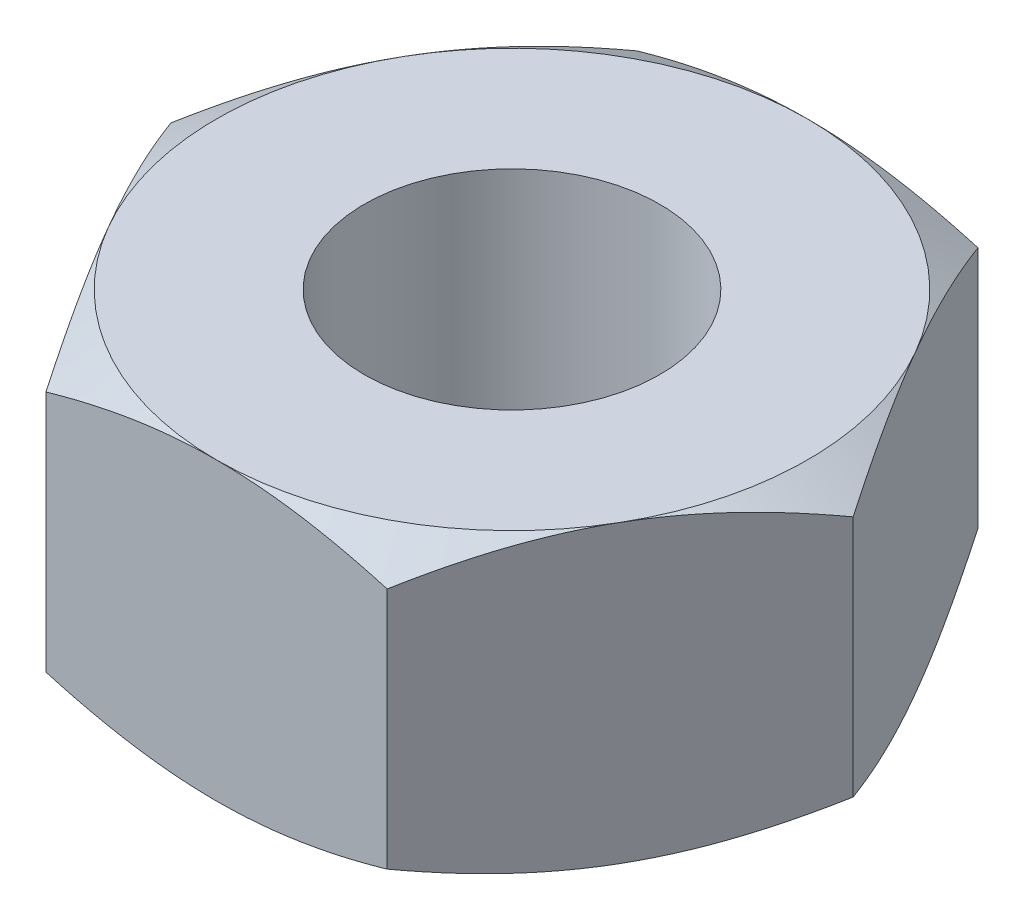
ISO-10303-21;
HEADER;
FILE_DESCRIPTION(('STEP AP214'),'2;1');
FILE_NAME('part.step','',(''),(''),'','','');
FILE_SCHEMA(('AUTOMOTIVE_DESIGN { 1 0 10303 214 1 1 1 1 }'));
ENDSEC;
DATA;
#1=APPLICATION_CONTEXT('core data for automotive mechanical design processes');
#2=APPLICATION_PROTOCOL_DEFINITION('international standard','automotive_design',2000,#1);
#3=PRODUCT_CONTEXT('',#1,'mechanical');
#4=PRODUCT('Part','Part','',(#3));
#5=PRODUCT_RELATED_PRODUCT_CATEGORY('part','',(#4));
#6=PRODUCT_DEFINITION_FORMATION('','',#4);
#7=PRODUCT_DEFINITION_CONTEXT('part definition',#1,'design');
#8=PRODUCT_DEFINITION('design','',#6,#7);
#9=PRODUCT_DEFINITION_SHAPE('','',#8);
#10=(LENGTH_UNIT() NAMED_UNIT(*) SI_UNIT(.MILLI.,.METRE.));
#11=(NAMED_UNIT(*) PLANE_ANGLE_UNIT() SI_UNIT($,.RADIAN.));
#12=(NAMED_UNIT(*) SI_UNIT($,.STERADIAN.) SOLID_ANGLE_UNIT());
#13=UNCERTAINTY_MEASURE_WITH_UNIT(LENGTH_MEASURE(1.E-05),#10,'distance_accuracy_value','');
#14=(GEOMETRIC_REPRESENTATION_CONTEXT(3) GLOBAL_UNCERTAINTY_ASSIGNED_CONTEXT((#13)) GLOBAL_UNIT_ASSIGNED_CONTEXT((#10,
#11,#12)) REPRESENTATION_CONTEXT('',''));
#15=CARTESIAN_POINT('',(0.,0.,0.));
#16=DIRECTION('',(0.,0.,1.));
#17=DIRECTION('',(1.,0.,0.));
#18=AXIS2_PLACEMENT_3D('',#15,#16,#17);
#19=CARTESIAN_POINT('',(2.88675134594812,2.5,5.00000000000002));
#20=DIRECTION('',(-0.866025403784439,0.,-0.499999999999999));
#21=DIRECTION('',(-0.499999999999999,0.,0.866025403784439));
#22=AXIS2_PLACEMENT_3D('',#19,#20,#21);
#23=PLANE('',#22);
#24=CARTESIAN_POINT('',(5.7736181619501,-2.05335134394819,-0.000200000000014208));
#25=CARTESIAN_POINT('',(5.64675433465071,-2.12661343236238,0.219534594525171));
#26=CARTESIAN_POINT('',(5.5188054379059,-2.19324867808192,0.441148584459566));
#27=CARTESIAN_POINT('',(5.26069210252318,-2.3095610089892,0.888213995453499));
#28=CARTESIAN_POINT('',(5.13052307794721,-2.35919695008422,1.11367335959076));
#29=CARTESIAN_POINT('',(4.87177839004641,-2.43644897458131,1.56183230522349));
#30=CARTESIAN_POINT('',(4.74324302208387,-2.46457962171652,1.78446209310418));
#31=CARTESIAN_POINT('',(4.54998783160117,-2.48980507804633,2.11918990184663));
#32=CARTESIAN_POINT('',(4.48552534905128,-2.49538654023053,2.23084219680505));
#33=CARTESIAN_POINT('',(4.35654081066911,-2.50079778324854,2.45424997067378));
#34=CARTESIAN_POINT('',(4.2920187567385,-2.50062774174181,2.5660054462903));
#35=CARTESIAN_POINT('',(4.11524635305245,-2.49224636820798,2.87218423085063));
#36=CARTESIAN_POINT('',(4.00305457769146,-2.47817022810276,3.0665060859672));
#37=CARTESIAN_POINT('',(3.77941563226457,-2.43353474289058,3.4538601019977));
#38=CARTESIAN_POINT('',(3.66796924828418,-2.40296013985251,3.64689090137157));
#39=CARTESIAN_POINT('',(3.44387972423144,-2.32653150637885,4.03502534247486));
#40=CARTESIAN_POINT('',(3.3312648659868,-2.28035362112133,4.23007999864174));
#41=CARTESIAN_POINT('',(3.1077146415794,-2.17554820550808,4.61728034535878));
#42=CARTESIAN_POINT('',(2.99677641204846,-2.11694529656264,4.8094309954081));
#43=CARTESIAN_POINT('',(2.88663587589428,-2.05335134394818,5.00020000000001));
#44=B_SPLINE_CURVE_WITH_KNOTS('',3,(#24,#25,#26,#27,#28,#29,#30,#31,#32,#33,#34,#35,#36,#37,#38,
#39,#40,#41,#42,#43),.UNSPECIFIED.,.F.,.F.,(4,2,2,2,2,2,2,2,2,4),(0.,0.792555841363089,
1.58701660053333,2.3618153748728,2.74884076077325,3.13585419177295,3.8096236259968,
4.4840172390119,5.17336882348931,5.86136694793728),.UNSPECIFIED.);
#45=CARTESIAN_POINT('',(5.77350269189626,-2.05341801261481,0.));
#46=VERTEX_POINT('',#45);
#47=CARTESIAN_POINT('',(4.33012701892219,-2.5,2.5));
#48=VERTEX_POINT('',#47);
#49=EDGE_CURVE('E47',#46,#48,#44,.T.);
#50=ORIENTED_EDGE('',*,*,#49,.F.);
#51=DIRECTION('',(0.,-1.,0.));
#52=VECTOR('',#51,1.);
#53=CARTESIAN_POINT('',(5.77350269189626,2.5,0.));
#54=LINE('',#53,#52);
#55=CARTESIAN_POINT('',(5.77350269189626,2.05341801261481,0.));
#56=VERTEX_POINT('',#55);
#57=EDGE_CURVE('E163',#56,#46,#54,.T.);
#58=ORIENTED_EDGE('',*,*,#57,.F.);
#59=CARTESIAN_POINT('',(2.88663587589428,2.05335134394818,5.00020000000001));
#60=CARTESIAN_POINT('',(3.01349970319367,2.12661343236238,4.78046540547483));
#61=CARTESIAN_POINT('',(3.14144859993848,2.19324867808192,4.55885141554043));
#62=CARTESIAN_POINT('',(3.3995619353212,2.3095610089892,4.1117860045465));
#63=CARTESIAN_POINT('',(3.52973095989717,2.35919695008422,3.88632664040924));
#64=CARTESIAN_POINT('',(3.78847564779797,2.43644897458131,3.4381676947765));
#65=CARTESIAN_POINT('',(3.91701101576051,2.46457962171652,3.21553790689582));
#66=CARTESIAN_POINT('',(4.11026620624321,2.48980507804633,2.88081009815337));
#67=CARTESIAN_POINT('',(4.1747286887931,2.49538654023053,2.76915780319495));
#68=CARTESIAN_POINT('',(4.30371322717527,2.50079778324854,2.54575002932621));
#69=CARTESIAN_POINT('',(4.36823528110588,2.50062774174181,2.4339945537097));
#70=CARTESIAN_POINT('',(4.54500768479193,2.49224636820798,2.12781576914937));
#71=CARTESIAN_POINT('',(4.65719946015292,2.47817022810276,1.93349391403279));
#72=CARTESIAN_POINT('',(4.88083840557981,2.43353474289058,1.5461398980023));
#73=CARTESIAN_POINT('',(4.9922847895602,2.40296013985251,1.35310909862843));
#74=CARTESIAN_POINT('',(5.21637431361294,2.32653150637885,0.964974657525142));
#75=CARTESIAN_POINT('',(5.32898917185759,2.28035362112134,0.769920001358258));
#76=CARTESIAN_POINT('',(5.55253939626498,2.17554820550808,0.382719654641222));
#77=CARTESIAN_POINT('',(5.66347762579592,2.11694529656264,0.190569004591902));
#78=CARTESIAN_POINT('',(5.7736181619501,2.05335134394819,-0.000200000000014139));
#79=B_SPLINE_CURVE_WITH_KNOTS('',3,(#59,#60,#61,#62,#63,#64,#65,#66,#67,#68,#69,#70,#71,#72,#73,
#74,#75,#76,#77,#78),.UNSPECIFIED.,.F.,.F.,(4,2,2,2,2,2,2,2,2,4),(0.,0.792555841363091,
1.58701660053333,2.36181537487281,2.74884076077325,3.13585419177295,3.8096236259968,
4.48401723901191,5.17336882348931,5.86136694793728),.UNSPECIFIED.);
#80=CARTESIAN_POINT('',(4.33012701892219,2.5,2.5));
#81=VERTEX_POINT('',#80);
#82=EDGE_CURVE('E246',#81,#56,#79,.T.);
#83=ORIENTED_EDGE('',*,*,#82,.F.);
#84=CARTESIAN_POINT('',(2.88675134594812,2.05341801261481,5.00000000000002));
#85=VERTEX_POINT('',#84);
#86=EDGE_CURVE('E256',#85,#81,#79,.T.);
#87=ORIENTED_EDGE('',*,*,#86,.F.);
#88=DIRECTION('',(0.,-1.,0.));
#89=VECTOR('',#88,1.);
#90=CARTESIAN_POINT('',(2.88675134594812,2.5,5.00000000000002));
#91=LINE('',#90,#89);
#92=CARTESIAN_POINT('',(2.88675134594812,-2.05341801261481,5.00000000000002));
#93=VERTEX_POINT('',#92);
#94=EDGE_CURVE('E150',#85,#93,#91,.T.);
#95=ORIENTED_EDGE('',*,*,#94,.T.);
#96=EDGE_CURVE('E142',#48,#93,#44,.T.);
#97=ORIENTED_EDGE('',*,*,#96,.F.);
#98=EDGE_LOOP('',(#50,#58,#83,#87,#95,#97));
#99=FACE_BOUND('',#98,.T.);
#100=ADVANCED_FACE('F31',(#99),#23,.F.);
#101=CARTESIAN_POINT('',(5.77350269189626,2.5,0.));
#102=DIRECTION('',(-0.866025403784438,0.,0.5));
#103=DIRECTION('',(0.5,0.,0.866025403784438));
#104=AXIS2_PLACEMENT_3D('',#101,#102,#103);
#105=PLANE('',#104);
#106=CARTESIAN_POINT('',(2.88663587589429,-2.05335134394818,-5.00020000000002));
#107=CARTESIAN_POINT('',(3.01349970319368,-2.12661343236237,-4.78046540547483));
#108=CARTESIAN_POINT('',(3.14144859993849,-2.19324867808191,-4.55885141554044));
#109=CARTESIAN_POINT('',(3.3995619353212,-2.3095610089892,-4.1117860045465));
#110=CARTESIAN_POINT('',(3.52973095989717,-2.35919695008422,-3.88632664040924));
#111=CARTESIAN_POINT('',(3.78847564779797,-2.43644897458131,-3.43816769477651));
#112=CARTESIAN_POINT('',(3.91701101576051,-2.46457962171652,-3.21553790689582));
#113=CARTESIAN_POINT('',(4.11026620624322,-2.48980507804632,-2.88081009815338));
#114=CARTESIAN_POINT('',(4.17472868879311,-2.49538654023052,-2.76915780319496));
#115=CARTESIAN_POINT('',(4.30371322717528,-2.50079778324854,-2.54575002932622));
#116=CARTESIAN_POINT('',(4.36823528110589,-2.5006277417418,-2.4339945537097));
#117=CARTESIAN_POINT('',(4.54500768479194,-2.49224636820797,-2.12781576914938));
#118=CARTESIAN_POINT('',(4.65719946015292,-2.47817022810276,-1.9334939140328));
#119=CARTESIAN_POINT('',(4.88083840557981,-2.43353474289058,-1.54613989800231));
#120=CARTESIAN_POINT('',(4.9922847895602,-2.4029601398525,-1.35310909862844));
#121=CARTESIAN_POINT('',(5.21637431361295,-2.32653150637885,-0.96497465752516));
#122=CARTESIAN_POINT('',(5.32898917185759,-2.28035362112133,-0.769920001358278));
#123=CARTESIAN_POINT('',(5.55253939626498,-2.17554820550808,-0.382719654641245));
#124=CARTESIAN_POINT('',(5.66347762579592,-2.11694529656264,-0.190569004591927));
#125=CARTESIAN_POINT('',(5.7736181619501,-2.05335134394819,0.000199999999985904));
#126=B_SPLINE_CURVE_WITH_KNOTS('',3,(#106,#107,#108,#109,#110,#111,#112,#113,#114,#115,#116,
#117,#118,#119,#120,#121,#122,#123,#124,#125),.UNSPECIFIED.,.F.,.F.,(4,2,2,2,2,2,2,2,2,4),(0.,
0.792555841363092,1.58701660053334,2.36181537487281,2.74884076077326,3.13585419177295,
3.8096236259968,4.4840172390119,5.17336882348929,5.86136694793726),.UNSPECIFIED.);
#127=CARTESIAN_POINT('',(2.88675134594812,-2.05341801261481,-5.00000000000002));
#128=VERTEX_POINT('',#127);
#129=CARTESIAN_POINT('',(4.3301270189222,-2.5,-2.5));
#130=VERTEX_POINT('',#129);
#131=EDGE_CURVE('E54',#128,#130,#126,.T.);
#132=ORIENTED_EDGE('',*,*,#131,.F.);
#133=DIRECTION('',(0.,-1.,0.));
#134=VECTOR('',#133,1.);
#135=CARTESIAN_POINT('',(2.88675134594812,2.5,-5.00000000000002));
#136=LINE('',#135,#134);
#137=CARTESIAN_POINT('',(2.88675134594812,2.05341801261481,-5.00000000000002));
#138=VERTEX_POINT('',#137);
#139=EDGE_CURVE('E160',#138,#128,#136,.T.);
#140=ORIENTED_EDGE('',*,*,#139,.F.);
#141=CARTESIAN_POINT('',(5.7736181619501,2.05335134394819,0.000199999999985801));
#142=CARTESIAN_POINT('',(5.64675433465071,2.12661343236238,-0.219534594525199));
#143=CARTESIAN_POINT('',(5.5188054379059,2.19324867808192,-0.441148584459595));
#144=CARTESIAN_POINT('',(5.26069210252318,2.3095610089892,-0.888213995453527));
#145=CARTESIAN_POINT('',(5.13052307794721,2.35919695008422,-1.11367335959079));
#146=CARTESIAN_POINT('',(4.87177839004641,2.43644897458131,-1.56183230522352));
#147=CARTESIAN_POINT('',(4.74324302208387,2.46457962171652,-1.7844620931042));
#148=CARTESIAN_POINT('',(4.54998783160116,2.48980507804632,-2.11918990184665));
#149=CARTESIAN_POINT('',(4.48552534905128,2.49538654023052,-2.23084219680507));
#150=CARTESIAN_POINT('',(4.35654081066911,2.50079778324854,-2.45424997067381));
#151=CARTESIAN_POINT('',(4.2920187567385,2.5006277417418,-2.56600544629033));
#152=CARTESIAN_POINT('',(4.11524635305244,2.49224636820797,-2.87218423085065));
#153=CARTESIAN_POINT('',(4.00305457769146,2.47817022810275,-3.06650608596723));
#154=CARTESIAN_POINT('',(3.77941563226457,2.43353474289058,-3.45386010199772));
#155=CARTESIAN_POINT('',(3.66796924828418,2.4029601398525,-3.64689090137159));
#156=CARTESIAN_POINT('',(3.44387972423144,2.32653150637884,-4.03502534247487));
#157=CARTESIAN_POINT('',(3.3312648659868,2.28035362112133,-4.23007999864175));
#158=CARTESIAN_POINT('',(3.1077146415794,2.17554820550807,-4.61728034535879));
#159=CARTESIAN_POINT('',(2.99677641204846,2.11694529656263,-4.80943099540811));
#160=CARTESIAN_POINT('',(2.88663587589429,2.05335134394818,-5.00020000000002));
#161=B_SPLINE_CURVE_WITH_KNOTS('',3,(#141,#142,#143,#144,#145,#146,#147,#148,#149,#150,#151,
#152,#153,#154,#155,#156,#157,#158,#159,#160),.UNSPECIFIED.,.F.,.F.,(4,2,2,2,2,2,2,2,2,4),(0.,
0.79255584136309,1.58701660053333,2.3618153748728,2.74884076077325,3.13585419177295,
3.80962362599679,4.48401723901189,5.17336882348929,5.86136694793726),.UNSPECIFIED.);
#162=CARTESIAN_POINT('',(4.3301270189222,2.5,-2.5));
#163=VERTEX_POINT('',#162);
#164=EDGE_CURVE('E255',#163,#138,#161,.T.);
#165=ORIENTED_EDGE('',*,*,#164,.F.);
#166=EDGE_CURVE('E251',#56,#163,#161,.T.);
#167=ORIENTED_EDGE('',*,*,#166,.F.);
#168=ORIENTED_EDGE('',*,*,#57,.T.);
#169=EDGE_CURVE('E268',#130,#46,#126,.T.);
#170=ORIENTED_EDGE('',*,*,#169,.F.);
#171=EDGE_LOOP('',(#132,#140,#165,#167,#168,#170));
#172=FACE_BOUND('',#171,.T.);
#173=ADVANCED_FACE('F257',(#172),#105,.F.);
#174=CARTESIAN_POINT('',(2.88675134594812,2.5,-5.00000000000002));
#175=DIRECTION('',(0.,0.,1.));
#176=DIRECTION('',(1.,0.,0.));
#177=AXIS2_PLACEMENT_3D('',#174,#175,#176);
#178=PLANE('',#177);
#179=CARTESIAN_POINT('',(-7.83582824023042,-0.0201818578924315,-5.00000000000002));
#180=CARTESIAN_POINT('',(-7.61675258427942,-0.126778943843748,-5.00000000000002));
#181=CARTESIAN_POINT('',(-7.39718272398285,-0.232377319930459,-5.00000000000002));
#182=CARTESIAN_POINT('',(-6.95679209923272,-0.441016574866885,-5.00000000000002));
#183=CARTESIAN_POINT('',(-6.73597115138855,-0.54405706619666,-5.00000000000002));
#184=CARTESIAN_POINT('',(-6.29171673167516,-0.747521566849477,-5.00000000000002));
#185=CARTESIAN_POINT('',(-6.06827562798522,-0.847928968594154,-5.00000000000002));
#186=CARTESIAN_POINT('',(-5.61964466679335,-1.04474266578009,-5.00000000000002));
#187=CARTESIAN_POINT('',(-5.39445489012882,-1.14114914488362,-5.00000000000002));
#188=CARTESIAN_POINT('',(-4.93438073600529,-1.33205603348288,-5.00000000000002));
#189=CARTESIAN_POINT('',(-4.69942447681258,-1.42638413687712,-5.00000000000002));
#190=CARTESIAN_POINT('',(-4.22679335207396,-1.60809698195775,-5.00000000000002));
#191=CARTESIAN_POINT('',(-3.98911818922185,-1.69548095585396,-5.00000000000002));
#192=CARTESIAN_POINT('',(-3.51109032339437,-1.86107114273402,-5.00000000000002));
#193=CARTESIAN_POINT('',(-3.27074388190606,-1.93929525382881,-5.00000000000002));
#194=CARTESIAN_POINT('',(-2.78660382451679,-2.08410963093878,-5.00000000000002));
#195=CARTESIAN_POINT('',(-2.54281129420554,-2.15070347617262,-5.00000000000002));
#196=CARTESIAN_POINT('',(-2.05301710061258,-2.26875493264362,-5.00000000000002));
#197=CARTESIAN_POINT('',(-1.80703640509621,-2.32029796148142,-5.00000000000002));
#198=CARTESIAN_POINT('',(-1.31193168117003,-2.40539626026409,-5.00000000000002));
#199=CARTESIAN_POINT('',(-1.0628079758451,-2.43895336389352,-5.00000000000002));
#200=CARTESIAN_POINT('',(-0.565948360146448,-2.48496717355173,-5.00000000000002));
#201=CARTESIAN_POINT('',(-0.318238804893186,-2.49770143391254,-5.00000000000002));
#202=CARTESIAN_POINT('',(0.17737746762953,-2.50172580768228,-5.00000000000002));
#203=CARTESIAN_POINT('',(0.425284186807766,-2.4930157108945,-5.00000000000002));
#204=CARTESIAN_POINT('',(0.843772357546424,-2.46083600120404,-5.00000000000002));
#205=CARTESIAN_POINT('',(1.01479089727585,-2.44270146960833,-5.00000000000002));
#206=CARTESIAN_POINT('',(1.35562158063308,-2.39731277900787,-5.00000000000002));
#207=CARTESIAN_POINT('',(1.52543356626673,-2.37005744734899,-5.00000000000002));
#208=CARTESIAN_POINT('',(2.0328088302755,-2.2760379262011,-5.00000000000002));
#209=CARTESIAN_POINT('',(2.36813213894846,-2.19703587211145,-5.00000000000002));
#210=CARTESIAN_POINT('',(2.86963272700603,-2.05946652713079,-5.00000000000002));
#211=CARTESIAN_POINT('',(3.03839424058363,-2.00977811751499,-5.00000000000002));
#212=CARTESIAN_POINT('',(3.37427940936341,-1.90509537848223,-5.00000000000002));
#213=CARTESIAN_POINT('',(3.54140305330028,-1.85010101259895,-5.00000000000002));
#214=CARTESIAN_POINT('',(3.87406252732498,-1.73570084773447,-5.00000000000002));
#215=CARTESIAN_POINT('',(4.03959882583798,-1.67629639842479,-5.00000000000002));
#216=CARTESIAN_POINT('',(4.36929036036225,-1.55378935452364,-5.00000000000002));
#217=CARTESIAN_POINT('',(4.53344561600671,-1.49068681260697,-5.00000000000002));
#218=CARTESIAN_POINT('',(4.93359002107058,-1.33251408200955,-5.00000000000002));
#219=CARTESIAN_POINT('',(5.16891080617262,-1.23575576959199,-5.00000000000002));
#220=CARTESIAN_POINT('',(5.63743106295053,-1.03721704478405,-5.00000000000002));
#221=CARTESIAN_POINT('',(5.87063037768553,-0.935436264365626,-5.00000000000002));
#222=CARTESIAN_POINT('',(6.33531777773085,-0.727904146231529,-5.00000000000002));
#223=CARTESIAN_POINT('',(6.56680543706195,-0.622151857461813,-5.00000000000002));
#224=CARTESIAN_POINT('',(7.02832278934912,-0.407506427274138,-5.00000000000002));
#225=CARTESIAN_POINT('',(7.25835244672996,-0.298613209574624,-5.00000000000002));
#226=CARTESIAN_POINT('',(7.71747583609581,-0.0781683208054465,-5.00000000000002));
#227=CARTESIAN_POINT('',(7.94656809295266,0.0333864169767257,-5.00000000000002));
#228=CARTESIAN_POINT('',(8.40373705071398,0.258559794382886,-5.00000000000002));
#229=CARTESIAN_POINT('',(8.63181374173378,0.372178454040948,-5.00000000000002));
#230=CARTESIAN_POINT('',(9.31470112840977,0.715524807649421,-5.00000000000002));
#231=CARTESIAN_POINT('',(9.76824174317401,0.947778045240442,-5.00000000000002));
#232=CARTESIAN_POINT('',(10.6324695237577,1.39599360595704,-5.00000000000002));
#233=CARTESIAN_POINT('',(11.0433644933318,1.61155711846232,-5.00000000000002));
#234=CARTESIAN_POINT('',(11.8636388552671,2.04558815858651,-5.00000000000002));
#235=CARTESIAN_POINT('',(12.2730181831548,2.26405580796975,-5.00000000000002));
#236=CARTESIAN_POINT('',(13.0894643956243,2.70257621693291,-5.00000000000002));
#237=CARTESIAN_POINT('',(13.4965345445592,2.9226229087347,-5.00000000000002));
#238=CARTESIAN_POINT('',(14.3097130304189,3.36442738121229,-5.00000000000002));
#239=CARTESIAN_POINT('',(14.7158214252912,3.58618505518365,-5.00000000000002));
#240=CARTESIAN_POINT('',(15.1215799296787,3.80857680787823,-5.00000000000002));
#241=B_SPLINE_CURVE_WITH_KNOTS('',3,(#179,#180,#181,#182,#183,#184,#185,#186,#187,#188,#189,
#190,#191,#192,#193,#194,#195,#196,#197,#198,#199,#200,#201,#202,#203,#204,#205,#206,#207,#208,
#209,#210,#211,#212,#213,#214,#215,#216,#217,#218,#219,#220,#221,#222,#223,#224,#225,#226,#227,
#228,#229,#230,#231,#232,#233,#234,#235,#236,#237,#238,#239,#240),.UNSPECIFIED.,.F.,.F.,(4,2,2,
2,2,2,2,2,2,2,2,2,2,2,2,2,2,2,2,2,2,2,2,2,2,2,2,2,2,2,4),(0.,0.730907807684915,1.46192568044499,
2.19678752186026,2.93161559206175,3.69108328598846,4.45063483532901,5.20867656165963,
5.96648458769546,6.71990430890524,7.47324720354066,8.21646418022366,8.95968844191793,
9.47537174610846,9.99112137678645,11.0231580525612,11.5508843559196,12.0786142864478,
12.6061833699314,13.1337449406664,13.8969744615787,14.6602599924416,15.4237294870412,
16.187217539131,16.9516324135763,17.7160547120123,19.2446573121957,20.636665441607,
22.0287321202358,23.416942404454,24.805066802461),.UNSPECIFIED.);
#242=CARTESIAN_POINT('',(-2.88675134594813,-2.0534180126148,-5.00000000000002));
#243=VERTEX_POINT('',#242);
#244=CARTESIAN_POINT('',(0.,-2.5,-5.00000000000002));
#245=VERTEX_POINT('',#244);
#246=EDGE_CURVE('E270',#243,#245,#241,.T.);
#247=ORIENTED_EDGE('',*,*,#246,.F.);
#248=DIRECTION('',(0.,-1.,0.));
#249=VECTOR('',#248,1.);
#250=CARTESIAN_POINT('',(-2.88675134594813,2.5,-5.00000000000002));
#251=LINE('',#250,#249);
#252=CARTESIAN_POINT('',(-2.88675134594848,2.05341801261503,-5.00000000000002));
#253=VERTEX_POINT('',#252);
#254=EDGE_CURVE('E152',#253,#243,#251,.T.);
#255=ORIENTED_EDGE('',*,*,#254,.F.);
#256=CARTESIAN_POINT('',(-7.83582824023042,0.0201818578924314,-5.00000000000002));
#257=CARTESIAN_POINT('',(-7.61675258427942,0.126778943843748,-5.00000000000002));
#258=CARTESIAN_POINT('',(-7.39718272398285,0.232377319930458,-5.00000000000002));
#259=CARTESIAN_POINT('',(-6.95679209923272,0.441016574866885,-5.00000000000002));
#260=CARTESIAN_POINT('',(-6.73597115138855,0.54405706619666,-5.00000000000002));
#261=CARTESIAN_POINT('',(-6.29171673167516,0.747521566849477,-5.00000000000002));
#262=CARTESIAN_POINT('',(-6.06827562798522,0.847928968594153,-5.00000000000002));
#263=CARTESIAN_POINT('',(-5.61964466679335,1.04474266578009,-5.00000000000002));
#264=CARTESIAN_POINT('',(-5.39445489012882,1.14114914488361,-5.00000000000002));
#265=CARTESIAN_POINT('',(-4.93438073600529,1.33205603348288,-5.00000000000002));
#266=CARTESIAN_POINT('',(-4.69942447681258,1.42638413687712,-5.00000000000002));
#267=CARTESIAN_POINT('',(-4.22679335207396,1.60809698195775,-5.00000000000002));
#268=CARTESIAN_POINT('',(-3.98911818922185,1.69548095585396,-5.00000000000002));
#269=CARTESIAN_POINT('',(-3.51109032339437,1.86107114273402,-5.00000000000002));
#270=CARTESIAN_POINT('',(-3.27074388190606,1.93929525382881,-5.00000000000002));
#271=CARTESIAN_POINT('',(-2.78660382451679,2.08410963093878,-5.00000000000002));
#272=CARTESIAN_POINT('',(-2.54281129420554,2.15070347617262,-5.00000000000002));
#273=CARTESIAN_POINT('',(-2.05301710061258,2.26875493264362,-5.00000000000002));
#274=CARTESIAN_POINT('',(-1.80703640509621,2.32029796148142,-5.00000000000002));
#275=CARTESIAN_POINT('',(-1.31193168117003,2.40539626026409,-5.00000000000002));
#276=CARTESIAN_POINT('',(-1.0628079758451,2.43895336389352,-5.00000000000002));
#277=CARTESIAN_POINT('',(-0.565948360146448,2.48496717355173,-5.00000000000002));
#278=CARTESIAN_POINT('',(-0.318238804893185,2.49770143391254,-5.00000000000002));
#279=CARTESIAN_POINT('',(0.177377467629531,2.50172580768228,-5.00000000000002));
#280=CARTESIAN_POINT('',(0.425284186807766,2.4930157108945,-5.00000000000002));
#281=CARTESIAN_POINT('',(0.843772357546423,2.46083600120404,-5.00000000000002));
#282=CARTESIAN_POINT('',(1.01479089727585,2.44270146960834,-5.00000000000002));
#283=CARTESIAN_POINT('',(1.35562158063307,2.39731277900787,-5.00000000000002));
#284=CARTESIAN_POINT('',(1.52543356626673,2.37005744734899,-5.00000000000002));
#285=CARTESIAN_POINT('',(2.0328088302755,2.2760379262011,-5.00000000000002));
#286=CARTESIAN_POINT('',(2.36813213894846,2.19703587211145,-5.00000000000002));
#287=CARTESIAN_POINT('',(2.86963272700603,2.05946652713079,-5.00000000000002));
#288=CARTESIAN_POINT('',(3.03839424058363,2.00977811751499,-5.00000000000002));
#289=CARTESIAN_POINT('',(3.37427940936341,1.90509537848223,-5.00000000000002));
#290=CARTESIAN_POINT('',(3.54140305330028,1.85010101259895,-5.00000000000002));
#291=CARTESIAN_POINT('',(3.87406252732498,1.73570084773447,-5.00000000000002));
#292=CARTESIAN_POINT('',(4.03959882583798,1.67629639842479,-5.00000000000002));
#293=CARTESIAN_POINT('',(4.36929036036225,1.55378935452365,-5.00000000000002));
#294=CARTESIAN_POINT('',(4.53344561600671,1.49068681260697,-5.00000000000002));
#295=CARTESIAN_POINT('',(4.93359002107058,1.33251408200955,-5.00000000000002));
#296=CARTESIAN_POINT('',(5.16891080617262,1.23575576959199,-5.00000000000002));
#297=CARTESIAN_POINT('',(5.63743106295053,1.03721704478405,-5.00000000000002));
#298=CARTESIAN_POINT('',(5.87063037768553,0.935436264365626,-5.00000000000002));
#299=CARTESIAN_POINT('',(6.33531777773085,0.727904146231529,-5.00000000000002));
#300=CARTESIAN_POINT('',(6.56680543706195,0.622151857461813,-5.00000000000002));
#301=CARTESIAN_POINT('',(7.02832278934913,0.407506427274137,-5.00000000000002));
#302=CARTESIAN_POINT('',(7.25835244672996,0.298613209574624,-5.00000000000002));
#303=CARTESIAN_POINT('',(7.71747583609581,0.0781683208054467,-5.00000000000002));
#304=CARTESIAN_POINT('',(7.94656809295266,-0.0333864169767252,-5.00000000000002));
#305=CARTESIAN_POINT('',(8.40373705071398,-0.258559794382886,-5.00000000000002));
#306=CARTESIAN_POINT('',(8.63181374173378,-0.372178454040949,-5.00000000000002));
#307=CARTESIAN_POINT('',(9.31470112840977,-0.715524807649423,-5.00000000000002));
#308=CARTESIAN_POINT('',(9.76824174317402,-0.947778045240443,-5.00000000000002));
#309=CARTESIAN_POINT('',(10.6324695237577,-1.39599360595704,-5.00000000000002));
#310=CARTESIAN_POINT('',(11.0433644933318,-1.61155711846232,-5.00000000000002));
#311=CARTESIAN_POINT('',(11.8636388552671,-2.04558815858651,-5.00000000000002));
#312=CARTESIAN_POINT('',(12.2730181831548,-2.26405580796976,-5.00000000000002));
#313=CARTESIAN_POINT('',(13.0894643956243,-2.70257621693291,-5.00000000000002));
#314=CARTESIAN_POINT('',(13.4965345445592,-2.92262290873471,-5.00000000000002));
#315=CARTESIAN_POINT('',(14.3097130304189,-3.36442738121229,-5.00000000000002));
#316=CARTESIAN_POINT('',(14.7158214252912,-3.58618505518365,-5.00000000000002));
#317=CARTESIAN_POINT('',(15.1215799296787,-3.80857680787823,-5.00000000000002));
#318=B_SPLINE_CURVE_WITH_KNOTS('',3,(#256,#257,#258,#259,#260,#261,#262,#263,#264,#265,#266,
#267,#268,#269,#270,#271,#272,#273,#274,#275,#276,#277,#278,#279,#280,#281,#282,#283,#284,#285,
#286,#287,#288,#289,#290,#291,#292,#293,#294,#295,#296,#297,#298,#299,#300,#301,#302,#303,#304,
#305,#306,#307,#308,#309,#310,#311,#312,#313,#314,#315,#316,#317),.UNSPECIFIED.,.F.,.F.,(4,2,2,
2,2,2,2,2,2,2,2,2,2,2,2,2,2,2,2,2,2,2,2,2,2,2,2,2,2,2,4),(0.,0.730907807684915,1.46192568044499,
2.19678752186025,2.93161559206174,3.69108328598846,4.450634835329,5.20867656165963,
5.96648458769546,6.71990430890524,7.47324720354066,8.21646418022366,8.95968844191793,
9.47537174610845,9.99112137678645,11.0231580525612,11.5508843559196,12.0786142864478,
12.6061833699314,13.1337449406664,13.8969744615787,14.6602599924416,15.4237294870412,
16.187217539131,16.9516324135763,17.7160547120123,19.2446573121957,20.636665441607,
22.0287321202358,23.416942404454,24.805066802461),.UNSPECIFIED.);
#319=CARTESIAN_POINT('',(0.,2.5,-5.00000000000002));
#320=VERTEX_POINT('',#319);
#321=EDGE_CURVE('E203',#320,#253,#318,.F.);
#322=ORIENTED_EDGE('',*,*,#321,.F.);
#323=EDGE_CURVE('E210',#138,#320,#318,.F.);
#324=ORIENTED_EDGE('',*,*,#323,.F.);
#325=ORIENTED_EDGE('',*,*,#139,.T.);
#326=EDGE_CURVE('E269',#245,#128,#241,.T.);
#327=ORIENTED_EDGE('',*,*,#326,.F.);
#328=EDGE_LOOP('',(#247,#255,#322,#324,#325,#327));
#329=FACE_BOUND('',#328,.T.);
#330=ADVANCED_FACE('F260',(#329),#178,.F.);
#331=CARTESIAN_POINT('',(-2.88675134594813,2.5,-5.00000000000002));
#332=DIRECTION('',(0.866025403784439,0.,0.5));
#333=DIRECTION('',(0.5,0.,-0.866025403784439));
#334=AXIS2_PLACEMENT_3D('',#331,#332,#333);
#335=PLANE('',#334);
#336=CARTESIAN_POINT('',(-5.77361816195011,-2.05335134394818,0.000199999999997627));
#337=CARTESIAN_POINT('',(-5.64675433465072,-2.12661343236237,-0.219534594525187));
#338=CARTESIAN_POINT('',(-5.51880543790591,-2.19324867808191,-0.441148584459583));
#339=CARTESIAN_POINT('',(-5.26069210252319,-2.30956100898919,-0.888213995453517));
#340=CARTESIAN_POINT('',(-5.13052307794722,-2.35919695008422,-1.11367335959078));
#341=CARTESIAN_POINT('',(-4.87177839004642,-2.43644897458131,-1.56183230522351));
#342=CARTESIAN_POINT('',(-4.74324302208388,-2.46457962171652,-1.7844620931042));
#343=CARTESIAN_POINT('',(-4.54998783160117,-2.48980507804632,-2.11918990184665));
#344=CARTESIAN_POINT('',(-4.48552534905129,-2.49538654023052,-2.23084219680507));
#345=CARTESIAN_POINT('',(-4.35654081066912,-2.50079778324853,-2.4542499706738));
#346=CARTESIAN_POINT('',(-4.29201875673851,-2.5006277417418,-2.56600544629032));
#347=CARTESIAN_POINT('',(-4.11524635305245,-2.49224636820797,-2.87218423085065));
#348=CARTESIAN_POINT('',(-4.00305457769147,-2.47817022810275,-3.06650608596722));
#349=CARTESIAN_POINT('',(-3.77941563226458,-2.43353474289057,-3.45386010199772));
#350=CARTESIAN_POINT('',(-3.66796924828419,-2.4029601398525,-3.64689090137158));
#351=CARTESIAN_POINT('',(-3.44387972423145,-2.32653150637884,-4.03502534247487));
#352=CARTESIAN_POINT('',(-3.33126486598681,-2.28035362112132,-4.23007999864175));
#353=CARTESIAN_POINT('',(-3.10771464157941,-2.17554820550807,-4.61728034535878));
#354=CARTESIAN_POINT('',(-2.99677641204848,-2.11694529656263,-4.8094309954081));
#355=CARTESIAN_POINT('',(-2.8866358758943,-2.05335134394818,-5.00020000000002));
#356=B_SPLINE_CURVE_WITH_KNOTS('',3,(#336,#337,#338,#339,#340,#341,#342,#343,#344,#345,#346,
#347,#348,#349,#350,#351,#352,#353,#354,#355),.UNSPECIFIED.,.F.,.F.,(4,2,2,2,2,2,2,2,2,4),(0.,
0.792555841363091,1.58701660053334,2.36181537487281,2.74884076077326,3.13585419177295,
3.8096236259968,4.4840172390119,5.1733688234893,5.86136694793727),.UNSPECIFIED.);
#357=CARTESIAN_POINT('',(-5.77350269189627,-2.05341801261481,0.));
#358=VERTEX_POINT('',#357);
#359=CARTESIAN_POINT('',(-4.3301270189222,-2.5,-2.5));
#360=VERTEX_POINT('',#359);
#361=EDGE_CURVE('E276',#358,#360,#356,.T.);
#362=ORIENTED_EDGE('',*,*,#361,.F.);
#363=DIRECTION('',(0.,-1.,0.));
#364=VECTOR('',#363,1.);
#365=CARTESIAN_POINT('',(-5.77350269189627,2.5,0.));
#366=LINE('',#365,#364);
#367=CARTESIAN_POINT('',(-5.77350269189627,2.05341801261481,0.));
#368=VERTEX_POINT('',#367);
#369=EDGE_CURVE('E149',#368,#358,#366,.T.);
#370=ORIENTED_EDGE('',*,*,#369,.F.);
#371=CARTESIAN_POINT('',(-2.8866358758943,2.05335134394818,-5.00020000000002));
#372=CARTESIAN_POINT('',(-3.01349970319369,2.12661343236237,-4.78046540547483));
#373=CARTESIAN_POINT('',(-3.1414485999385,2.19324867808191,-4.55885141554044));
#374=CARTESIAN_POINT('',(-3.39956193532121,2.30956100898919,-4.1117860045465));
#375=CARTESIAN_POINT('',(-3.52973095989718,2.35919695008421,-3.88632664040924));
#376=CARTESIAN_POINT('',(-3.78847564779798,2.43644897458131,-3.4381676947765));
#377=CARTESIAN_POINT('',(-3.91701101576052,2.46457962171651,-3.21553790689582));
#378=CARTESIAN_POINT('',(-4.11026620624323,2.48980507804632,-2.88081009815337));
#379=CARTESIAN_POINT('',(-4.17472868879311,2.49538654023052,-2.76915780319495));
#380=CARTESIAN_POINT('',(-4.30371322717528,2.50079778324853,-2.54575002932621));
#381=CARTESIAN_POINT('',(-4.3682352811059,2.5006277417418,-2.4339945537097));
#382=CARTESIAN_POINT('',(-4.54500768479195,2.49224636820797,-2.12781576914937));
#383=CARTESIAN_POINT('',(-4.65719946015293,2.47817022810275,-1.9334939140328));
#384=CARTESIAN_POINT('',(-4.88083840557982,2.43353474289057,-1.5461398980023));
#385=CARTESIAN_POINT('',(-4.99228478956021,2.4029601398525,-1.35310909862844));
#386=CARTESIAN_POINT('',(-5.21637431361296,2.32653150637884,-0.964974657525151));
#387=CARTESIAN_POINT('',(-5.3289891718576,2.28035362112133,-0.769920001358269));
#388=CARTESIAN_POINT('',(-5.55253939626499,2.17554820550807,-0.382719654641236));
#389=CARTESIAN_POINT('',(-5.66347762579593,2.11694529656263,-0.190569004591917));
#390=CARTESIAN_POINT('',(-5.77361816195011,2.05335134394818,0.000199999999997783));
#391=B_SPLINE_CURVE_WITH_KNOTS('',3,(#371,#372,#373,#374,#375,#376,#377,#378,#379,#380,#381,
#382,#383,#384,#385,#386,#387,#388,#389,#390),.UNSPECIFIED.,.F.,.F.,(4,2,2,2,2,2,2,2,2,4),(0.,
0.792555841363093,1.58701660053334,2.36181537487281,2.74884076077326,3.13585419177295,
3.8096236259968,4.4840172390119,5.1733688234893,5.86136694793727),.UNSPECIFIED.);
#392=CARTESIAN_POINT('',(-4.3301270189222,2.5,-2.5));
#393=VERTEX_POINT('',#392);
#394=EDGE_CURVE('E193',#393,#368,#391,.T.);
#395=ORIENTED_EDGE('',*,*,#394,.F.);
#396=EDGE_CURVE('E196',#253,#393,#391,.T.);
#397=ORIENTED_EDGE('',*,*,#396,.F.);
#398=ORIENTED_EDGE('',*,*,#254,.T.);
#399=EDGE_CURVE('E275',#360,#243,#356,.T.);
#400=ORIENTED_EDGE('',*,*,#399,.F.);
#401=EDGE_LOOP('',(#362,#370,#395,#397,#398,#400));
#402=FACE_BOUND('',#401,.T.);
#403=ADVANCED_FACE('F195',(#402),#335,.F.);
#404=CARTESIAN_POINT('',(-5.77350269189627,2.5,0.));
#405=DIRECTION('',(0.866025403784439,0.,-0.5));
#406=DIRECTION('',(-0.5,0.,-0.866025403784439));
#407=AXIS2_PLACEMENT_3D('',#404,#405,#406);
#408=PLANE('',#407);
#409=CARTESIAN_POINT('',(-2.88663587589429,-2.05335134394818,5.00020000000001));
#410=CARTESIAN_POINT('',(-3.01349970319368,-2.12661343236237,4.78046540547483));
#411=CARTESIAN_POINT('',(-3.14144859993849,-2.19324867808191,4.55885141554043));
#412=CARTESIAN_POINT('',(-3.39956193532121,-2.3095610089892,4.1117860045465));
#413=CARTESIAN_POINT('',(-3.52973095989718,-2.35919695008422,3.88632664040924));
#414=CARTESIAN_POINT('',(-3.78847564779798,-2.43644897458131,3.4381676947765));
#415=CARTESIAN_POINT('',(-3.91701101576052,-2.46457962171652,3.21553790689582));
#416=CARTESIAN_POINT('',(-4.11026620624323,-2.48980507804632,2.88081009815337));
#417=CARTESIAN_POINT('',(-4.17472868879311,-2.49538654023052,2.76915780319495));
#418=CARTESIAN_POINT('',(-4.30371322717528,-2.50079778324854,2.54575002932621));
#419=CARTESIAN_POINT('',(-4.36823528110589,-2.5006277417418,2.4339945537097));
#420=CARTESIAN_POINT('',(-4.54500768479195,-2.49224636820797,2.12781576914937));
#421=CARTESIAN_POINT('',(-4.65719946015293,-2.47817022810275,1.9334939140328));
#422=CARTESIAN_POINT('',(-4.88083840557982,-2.43353474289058,1.5461398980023));
#423=CARTESIAN_POINT('',(-4.99228478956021,-2.4029601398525,1.35310909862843));
#424=CARTESIAN_POINT('',(-5.21637431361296,-2.32653150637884,0.964974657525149));
#425=CARTESIAN_POINT('',(-5.3289891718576,-2.28035362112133,0.769920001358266));
#426=CARTESIAN_POINT('',(-5.55253939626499,-2.17554820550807,0.382719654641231));
#427=CARTESIAN_POINT('',(-5.66347762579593,-2.11694529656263,0.190569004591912));
#428=CARTESIAN_POINT('',(-5.77361816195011,-2.05335134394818,-0.000200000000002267));
#429=B_SPLINE_CURVE_WITH_KNOTS('',3,(#409,#410,#411,#412,#413,#414,#415,#416,#417,#418,#419,
#420,#421,#422,#423,#424,#425,#426,#427,#428),.UNSPECIFIED.,.F.,.F.,(4,2,2,2,2,2,2,2,2,4),(0.,
0.792555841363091,1.58701660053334,2.36181537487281,2.74884076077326,3.13585419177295,
3.8096236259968,4.4840172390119,5.1733688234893,5.86136694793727),.UNSPECIFIED.);
#430=CARTESIAN_POINT('',(-2.88675134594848,-2.05341801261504,5.00000000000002));
#431=VERTEX_POINT('',#430);
#432=CARTESIAN_POINT('',(-4.3301270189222,-2.5,2.5));
#433=VERTEX_POINT('',#432);
#434=EDGE_CURVE('E125',#431,#433,#429,.T.);
#435=ORIENTED_EDGE('',*,*,#434,.F.);
#436=DIRECTION('',(0.,-1.,0.));
#437=VECTOR('',#436,1.);
#438=CARTESIAN_POINT('',(-2.88675134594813,2.5,5.00000000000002));
#439=LINE('',#438,#437);
#440=CARTESIAN_POINT('',(-2.88675134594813,2.0534180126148,5.00000000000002));
#441=VERTEX_POINT('',#440);
#442=EDGE_CURVE('E139',#441,#431,#439,.T.);
#443=ORIENTED_EDGE('',*,*,#442,.F.);
#444=CARTESIAN_POINT('',(-5.77361816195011,2.05335134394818,-0.000200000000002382));
#445=CARTESIAN_POINT('',(-5.64675433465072,2.12661343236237,0.219534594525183));
#446=CARTESIAN_POINT('',(-5.51880543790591,2.19324867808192,0.441148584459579));
#447=CARTESIAN_POINT('',(-5.26069210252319,2.3095610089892,0.888213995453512));
#448=CARTESIAN_POINT('',(-5.13052307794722,2.35919695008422,1.11367335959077));
#449=CARTESIAN_POINT('',(-4.87177839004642,2.43644897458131,1.56183230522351));
#450=CARTESIAN_POINT('',(-4.74324302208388,2.46457962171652,1.78446209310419));
#451=CARTESIAN_POINT('',(-4.54998783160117,2.48980507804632,2.11918990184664));
#452=CARTESIAN_POINT('',(-4.48552534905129,2.49538654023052,2.23084219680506));
#453=CARTESIAN_POINT('',(-4.35654081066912,2.50079778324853,2.4542499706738));
#454=CARTESIAN_POINT('',(-4.29201875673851,2.5006277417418,2.56600544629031));
#455=CARTESIAN_POINT('',(-4.11524635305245,2.49224636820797,2.87218423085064));
#456=CARTESIAN_POINT('',(-4.00305457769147,2.47817022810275,3.06650608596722));
#457=CARTESIAN_POINT('',(-3.77941563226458,2.43353474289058,3.45386010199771));
#458=CARTESIAN_POINT('',(-3.66796924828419,2.4029601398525,3.64689090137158));
#459=CARTESIAN_POINT('',(-3.44387972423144,2.32653150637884,4.03502534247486));
#460=CARTESIAN_POINT('',(-3.33126486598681,2.28035362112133,4.23007999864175));
#461=CARTESIAN_POINT('',(-3.10771464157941,2.17554820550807,4.61728034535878));
#462=CARTESIAN_POINT('',(-2.99677641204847,2.11694529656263,4.8094309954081));
#463=CARTESIAN_POINT('',(-2.88663587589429,2.05335134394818,5.00020000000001));
#464=B_SPLINE_CURVE_WITH_KNOTS('',3,(#444,#445,#446,#447,#448,#449,#450,#451,#452,#453,#454,
#455,#456,#457,#458,#459,#460,#461,#462,#463),.UNSPECIFIED.,.F.,.F.,(4,2,2,2,2,2,2,2,2,4),(0.,
0.792555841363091,1.58701660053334,2.36181537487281,2.74884076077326,3.13585419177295,
3.8096236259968,4.4840172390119,5.1733688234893,5.86136694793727),.UNSPECIFIED.);
#465=CARTESIAN_POINT('',(-4.3301270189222,2.5,2.5));
#466=VERTEX_POINT('',#465);
#467=EDGE_CURVE('E202',#466,#441,#464,.T.);
#468=ORIENTED_EDGE('',*,*,#467,.F.);
#469=EDGE_CURVE('E200',#368,#466,#464,.T.);
#470=ORIENTED_EDGE('',*,*,#469,.F.);
#471=ORIENTED_EDGE('',*,*,#369,.T.);
#472=EDGE_CURVE('E141',#433,#358,#429,.T.);
#473=ORIENTED_EDGE('',*,*,#472,.F.);
#474=EDGE_LOOP('',(#435,#443,#468,#470,#471,#473));
#475=FACE_BOUND('',#474,.T.);
#476=ADVANCED_FACE('F137',(#475),#408,.F.);
#477=CARTESIAN_POINT('',(-2.88675134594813,2.5,5.00000000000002));
#478=DIRECTION('',(0.,0.,-1.));
#479=DIRECTION('',(-1.,0.,0.));
#480=AXIS2_PLACEMENT_3D('',#477,#478,#479);
#481=PLANE('',#480);
#482=CARTESIAN_POINT('',(-7.83582824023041,-0.0201818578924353,5.00000000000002));
#483=CARTESIAN_POINT('',(-7.61675258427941,-0.126778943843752,5.00000000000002));
#484=CARTESIAN_POINT('',(-7.39718272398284,-0.232377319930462,5.00000000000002));
#485=CARTESIAN_POINT('',(-6.95679209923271,-0.441016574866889,5.00000000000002));
#486=CARTESIAN_POINT('',(-6.73597115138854,-0.544057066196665,5.00000000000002));
#487=CARTESIAN_POINT('',(-6.29171673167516,-0.747521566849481,5.00000000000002));
#488=CARTESIAN_POINT('',(-6.06827562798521,-0.847928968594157,5.00000000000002));
#489=CARTESIAN_POINT('',(-5.61964466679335,-1.0447426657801,5.00000000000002));
#490=CARTESIAN_POINT('',(-5.39445489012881,-1.14114914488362,5.00000000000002));
#491=CARTESIAN_POINT('',(-4.93438073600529,-1.33205603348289,5.00000000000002));
#492=CARTESIAN_POINT('',(-4.69942447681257,-1.42638413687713,5.00000000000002));
#493=CARTESIAN_POINT('',(-4.22679335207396,-1.60809698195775,5.00000000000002));
#494=CARTESIAN_POINT('',(-3.98911818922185,-1.69548095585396,5.00000000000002));
#495=CARTESIAN_POINT('',(-3.51109032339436,-1.86107114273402,5.00000000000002));
#496=CARTESIAN_POINT('',(-3.27074388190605,-1.93929525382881,5.00000000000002));
#497=CARTESIAN_POINT('',(-2.78660382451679,-2.08410963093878,5.00000000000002));
#498=CARTESIAN_POINT('',(-2.54281129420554,-2.15070347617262,5.00000000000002));
#499=CARTESIAN_POINT('',(-2.05301710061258,-2.26875493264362,5.00000000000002));
#500=CARTESIAN_POINT('',(-1.80703640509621,-2.32029796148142,5.00000000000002));
#501=CARTESIAN_POINT('',(-1.31193168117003,-2.40539626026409,5.00000000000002));
#502=CARTESIAN_POINT('',(-1.0628079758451,-2.43895336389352,5.00000000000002));
#503=CARTESIAN_POINT('',(-0.565948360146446,-2.48496717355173,5.00000000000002));
#504=CARTESIAN_POINT('',(-0.318238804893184,-2.49770143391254,5.00000000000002));
#505=CARTESIAN_POINT('',(0.177377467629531,-2.50172580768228,5.00000000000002));
#506=CARTESIAN_POINT('',(0.425284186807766,-2.4930157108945,5.00000000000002));
#507=CARTESIAN_POINT('',(0.843772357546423,-2.46083600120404,5.00000000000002));
#508=CARTESIAN_POINT('',(1.01479089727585,-2.44270146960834,5.00000000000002));
#509=CARTESIAN_POINT('',(1.35562158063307,-2.39731277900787,5.00000000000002));
#510=CARTESIAN_POINT('',(1.52543356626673,-2.37005744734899,5.00000000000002));
#511=CARTESIAN_POINT('',(2.0328088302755,-2.2760379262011,5.00000000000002));
#512=CARTESIAN_POINT('',(2.36813213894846,-2.19703587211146,5.00000000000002));
#513=CARTESIAN_POINT('',(2.86963272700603,-2.05946652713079,5.00000000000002));
#514=CARTESIAN_POINT('',(3.03839424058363,-2.009778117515,5.00000000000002));
#515=CARTESIAN_POINT('',(3.37427940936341,-1.90509537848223,5.00000000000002));
#516=CARTESIAN_POINT('',(3.54140305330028,-1.85010101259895,5.00000000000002));
#517=CARTESIAN_POINT('',(3.87406252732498,-1.73570084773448,5.00000000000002));
#518=CARTESIAN_POINT('',(4.03959882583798,-1.6762963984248,5.00000000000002));
#519=CARTESIAN_POINT('',(4.36929036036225,-1.55378935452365,5.00000000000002));
#520=CARTESIAN_POINT('',(4.53344561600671,-1.49068681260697,5.00000000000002));
#521=CARTESIAN_POINT('',(4.93359002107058,-1.33251408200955,5.00000000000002));
#522=CARTESIAN_POINT('',(5.16891080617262,-1.23575576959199,5.00000000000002));
#523=CARTESIAN_POINT('',(5.63743106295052,-1.03721704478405,5.00000000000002));
#524=CARTESIAN_POINT('',(5.87063037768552,-0.935436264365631,5.00000000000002));
#525=CARTESIAN_POINT('',(6.33531777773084,-0.727904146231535,5.00000000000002));
#526=CARTESIAN_POINT('',(6.56680543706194,-0.62215185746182,5.00000000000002));
#527=CARTESIAN_POINT('',(7.02832278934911,-0.407506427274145,5.00000000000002));
#528=CARTESIAN_POINT('',(7.25835244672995,-0.298613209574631,5.00000000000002));
#529=CARTESIAN_POINT('',(7.71747583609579,-0.0781683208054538,5.00000000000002));
#530=CARTESIAN_POINT('',(7.94656809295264,0.0333864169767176,5.00000000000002));
#531=CARTESIAN_POINT('',(8.40373705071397,0.258559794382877,5.00000000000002));
#532=CARTESIAN_POINT('',(8.63181374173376,0.372178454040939,5.00000000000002));
#533=CARTESIAN_POINT('',(9.31470112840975,0.715524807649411,5.00000000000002));
#534=CARTESIAN_POINT('',(9.76824174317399,0.94777804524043,5.00000000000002));
#535=CARTESIAN_POINT('',(10.6324695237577,1.39599360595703,5.00000000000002));
#536=CARTESIAN_POINT('',(11.0433644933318,1.61155711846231,5.00000000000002));
#537=CARTESIAN_POINT('',(11.8636388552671,2.0455881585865,5.00000000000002));
#538=CARTESIAN_POINT('',(12.2730181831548,2.26405580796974,5.00000000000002));
#539=CARTESIAN_POINT('',(13.0894643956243,2.7025762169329,5.00000000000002));
#540=CARTESIAN_POINT('',(13.4965345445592,2.92262290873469,5.00000000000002));
#541=CARTESIAN_POINT('',(14.3097130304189,3.36442738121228,5.00000000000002));
#542=CARTESIAN_POINT('',(14.7158214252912,3.58618505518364,5.00000000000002));
#543=CARTESIAN_POINT('',(15.1215799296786,3.80857680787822,5.00000000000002));
#544=B_SPLINE_CURVE_WITH_KNOTS('',3,(#482,#483,#484,#485,#486,#487,#488,#489,#490,#491,#492,
#493,#494,#495,#496,#497,#498,#499,#500,#501,#502,#503,#504,#505,#506,#507,#508,#509,#510,#511,
#512,#513,#514,#515,#516,#517,#518,#519,#520,#521,#522,#523,#524,#525,#526,#527,#528,#529,#530,
#531,#532,#533,#534,#535,#536,#537,#538,#539,#540,#541,#542,#543),.UNSPECIFIED.,.F.,.F.,(4,2,2,
2,2,2,2,2,2,2,2,2,2,2,2,2,2,2,2,2,2,2,2,2,2,2,2,2,2,2,4),(0.,0.730907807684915,1.46192568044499,
2.19678752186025,2.93161559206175,3.69108328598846,4.450634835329,5.20867656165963,
5.96648458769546,6.71990430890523,7.47324720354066,8.21646418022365,8.95968844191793,
9.47537174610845,9.99112137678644,11.0231580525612,11.5508843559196,12.0786142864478,
12.6061833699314,13.1337449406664,13.8969744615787,14.6602599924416,15.4237294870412,
16.1872175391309,16.9516324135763,17.7160547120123,19.2446573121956,20.636665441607,
22.0287321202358,23.416942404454,24.805066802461),.UNSPECIFIED.);
#545=CARTESIAN_POINT('',(0.,-2.5,5.00000000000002));
#546=VERTEX_POINT('',#545);
#547=EDGE_CURVE('E133',#93,#546,#544,.F.);
#548=ORIENTED_EDGE('',*,*,#547,.F.);
#549=ORIENTED_EDGE('',*,*,#94,.F.);
#550=CARTESIAN_POINT('',(-7.83582824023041,0.0201818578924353,5.00000000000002));
#551=CARTESIAN_POINT('',(-7.61675258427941,0.126778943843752,5.00000000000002));
#552=CARTESIAN_POINT('',(-7.39718272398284,0.232377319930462,5.00000000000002));
#553=CARTESIAN_POINT('',(-6.95679209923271,0.441016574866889,5.00000000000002));
#554=CARTESIAN_POINT('',(-6.73597115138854,0.544057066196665,5.00000000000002));
#555=CARTESIAN_POINT('',(-6.29171673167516,0.747521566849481,5.00000000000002));
#556=CARTESIAN_POINT('',(-6.06827562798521,0.847928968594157,5.00000000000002));
#557=CARTESIAN_POINT('',(-5.61964466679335,1.0447426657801,5.00000000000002));
#558=CARTESIAN_POINT('',(-5.39445489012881,1.14114914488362,5.00000000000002));
#559=CARTESIAN_POINT('',(-4.93438073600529,1.33205603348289,5.00000000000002));
#560=CARTESIAN_POINT('',(-4.69942447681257,1.42638413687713,5.00000000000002));
#561=CARTESIAN_POINT('',(-4.22679335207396,1.60809698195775,5.00000000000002));
#562=CARTESIAN_POINT('',(-3.98911818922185,1.69548095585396,5.00000000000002));
#563=CARTESIAN_POINT('',(-3.51109032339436,1.86107114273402,5.00000000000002));
#564=CARTESIAN_POINT('',(-3.27074388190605,1.93929525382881,5.00000000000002));
#565=CARTESIAN_POINT('',(-2.78660382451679,2.08410963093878,5.00000000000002));
#566=CARTESIAN_POINT('',(-2.54281129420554,2.15070347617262,5.00000000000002));
#567=CARTESIAN_POINT('',(-2.05301710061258,2.26875493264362,5.00000000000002));
#568=CARTESIAN_POINT('',(-1.80703640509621,2.32029796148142,5.00000000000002));
#569=CARTESIAN_POINT('',(-1.31193168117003,2.40539626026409,5.00000000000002));
#570=CARTESIAN_POINT('',(-1.0628079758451,2.43895336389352,5.00000000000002));
#571=CARTESIAN_POINT('',(-0.565948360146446,2.48496717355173,5.00000000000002));
#572=CARTESIAN_POINT('',(-0.318238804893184,2.49770143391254,5.00000000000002));
#573=CARTESIAN_POINT('',(0.177377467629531,2.50172580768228,5.00000000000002));
#574=CARTESIAN_POINT('',(0.425284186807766,2.4930157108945,5.00000000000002));
#575=CARTESIAN_POINT('',(0.843772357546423,2.46083600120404,5.00000000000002));
#576=CARTESIAN_POINT('',(1.01479089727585,2.44270146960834,5.00000000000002));
#577=CARTESIAN_POINT('',(1.35562158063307,2.39731277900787,5.00000000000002));
#578=CARTESIAN_POINT('',(1.52543356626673,2.37005744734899,5.00000000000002));
#579=CARTESIAN_POINT('',(2.0328088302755,2.2760379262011,5.00000000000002));
#580=CARTESIAN_POINT('',(2.36813213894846,2.19703587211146,5.00000000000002));
#581=CARTESIAN_POINT('',(2.86963272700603,2.05946652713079,5.00000000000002));
#582=CARTESIAN_POINT('',(3.03839424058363,2.009778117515,5.00000000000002));
#583=CARTESIAN_POINT('',(3.37427940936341,1.90509537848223,5.00000000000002));
#584=CARTESIAN_POINT('',(3.54140305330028,1.85010101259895,5.00000000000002));
#585=CARTESIAN_POINT('',(3.87406252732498,1.73570084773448,5.00000000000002));
#586=CARTESIAN_POINT('',(4.03959882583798,1.6762963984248,5.00000000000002));
#587=CARTESIAN_POINT('',(4.36929036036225,1.55378935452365,5.00000000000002));
#588=CARTESIAN_POINT('',(4.53344561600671,1.49068681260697,5.00000000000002));
#589=CARTESIAN_POINT('',(4.93359002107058,1.33251408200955,5.00000000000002));
#590=CARTESIAN_POINT('',(5.16891080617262,1.23575576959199,5.00000000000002));
#591=CARTESIAN_POINT('',(5.63743106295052,1.03721704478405,5.00000000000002));
#592=CARTESIAN_POINT('',(5.87063037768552,0.935436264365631,5.00000000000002));
#593=CARTESIAN_POINT('',(6.33531777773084,0.727904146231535,5.00000000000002));
#594=CARTESIAN_POINT('',(6.56680543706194,0.62215185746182,5.00000000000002));
#595=CARTESIAN_POINT('',(7.02832278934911,0.407506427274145,5.00000000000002));
#596=CARTESIAN_POINT('',(7.25835244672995,0.298613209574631,5.00000000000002));
#597=CARTESIAN_POINT('',(7.71747583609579,0.078168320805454,5.00000000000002));
#598=CARTESIAN_POINT('',(7.94656809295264,-0.0333864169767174,5.00000000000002));
#599=CARTESIAN_POINT('',(8.40373705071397,-0.258559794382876,5.00000000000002));
#600=CARTESIAN_POINT('',(8.63181374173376,-0.372178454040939,5.00000000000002));
#601=CARTESIAN_POINT('',(9.31470112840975,-0.715524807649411,5.00000000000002));
#602=CARTESIAN_POINT('',(9.76824174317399,-0.94777804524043,5.00000000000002));
#603=CARTESIAN_POINT('',(10.6324695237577,-1.39599360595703,5.00000000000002));
#604=CARTESIAN_POINT('',(11.0433644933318,-1.61155711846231,5.00000000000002));
#605=CARTESIAN_POINT('',(11.8636388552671,-2.0455881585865,5.00000000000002));
#606=CARTESIAN_POINT('',(12.2730181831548,-2.26405580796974,5.00000000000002));
#607=CARTESIAN_POINT('',(13.0894643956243,-2.7025762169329,5.00000000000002));
#608=CARTESIAN_POINT('',(13.4965345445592,-2.92262290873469,5.00000000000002));
#609=CARTESIAN_POINT('',(14.3097130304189,-3.36442738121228,5.00000000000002));
#610=CARTESIAN_POINT('',(14.7158214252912,-3.58618505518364,5.00000000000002));
#611=CARTESIAN_POINT('',(15.1215799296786,-3.80857680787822,5.00000000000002));
#612=B_SPLINE_CURVE_WITH_KNOTS('',3,(#550,#551,#552,#553,#554,#555,#556,#557,#558,#559,#560,
#561,#562,#563,#564,#565,#566,#567,#568,#569,#570,#571,#572,#573,#574,#575,#576,#577,#578,#579,
#580,#581,#582,#583,#584,#585,#586,#587,#588,#589,#590,#591,#592,#593,#594,#595,#596,#597,#598,
#599,#600,#601,#602,#603,#604,#605,#606,#607,#608,#609,#610,#611),.UNSPECIFIED.,.F.,.F.,(4,2,2,
2,2,2,2,2,2,2,2,2,2,2,2,2,2,2,2,2,2,2,2,2,2,2,2,2,2,2,4),(0.,0.730907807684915,1.46192568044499,
2.19678752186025,2.93161559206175,3.69108328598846,4.450634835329,5.20867656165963,
5.96648458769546,6.71990430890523,7.47324720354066,8.21646418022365,8.95968844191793,
9.47537174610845,9.99112137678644,11.0231580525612,11.5508843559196,12.0786142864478,
12.6061833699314,13.1337449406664,13.8969744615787,14.6602599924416,15.4237294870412,
16.1872175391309,16.9516324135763,17.7160547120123,19.2446573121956,20.636665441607,
22.0287321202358,23.416942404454,24.805066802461),.UNSPECIFIED.);
#613=CARTESIAN_POINT('',(0.,2.5,5.00000000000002));
#614=VERTEX_POINT('',#613);
#615=EDGE_CURVE('E237',#614,#85,#612,.T.);
#616=ORIENTED_EDGE('',*,*,#615,.F.);
#617=EDGE_CURVE('E148',#441,#614,#612,.T.);
#618=ORIENTED_EDGE('',*,*,#617,.F.);
#619=ORIENTED_EDGE('',*,*,#442,.T.);
#620=EDGE_CURVE('E122',#546,#431,#544,.F.);
#621=ORIENTED_EDGE('',*,*,#620,.F.);
#622=EDGE_LOOP('',(#548,#549,#616,#618,#619,#621));
#623=FACE_BOUND('',#622,.T.);
#624=ADVANCED_FACE('F145',(#623),#481,.F.);
#625=CARTESIAN_POINT('',(0.,4.23205080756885,0.));
#626=DIRECTION('',(0.,-1.,0.));
#627=DIRECTION('',(0.,0.,-1.));
#628=AXIS2_PLACEMENT_3D('',#625,#626,#627);
#629=CONICAL_SURFACE('',#628,2.00000000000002,1.0471975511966);
#630=ORIENTED_EDGE('',*,*,#617,.T.);
#631=CARTESIAN_POINT('',(0.,2.5,0.));
#632=DIRECTION('',(0.,1.,0.));
#633=DIRECTION('',(0.,0.,1.));
#634=AXIS2_PLACEMENT_3D('',#631,#632,#633);
#635=CIRCLE('',#634,5.00000000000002);
#636=EDGE_CURVE('E165',#466,#614,#635,.T.);
#637=ORIENTED_EDGE('',*,*,#636,.F.);
#638=ORIENTED_EDGE('',*,*,#467,.T.);
#639=EDGE_LOOP('',(#630,#637,#638));
#640=FACE_BOUND('',#639,.T.);
#641=ADVANCED_FACE('F221',(#640),#629,.T.);
#642=ORIENTED_EDGE('',*,*,#469,.T.);
#643=EDGE_CURVE('E166',#393,#466,#635,.T.);
#644=ORIENTED_EDGE('',*,*,#643,.F.);
#645=ORIENTED_EDGE('',*,*,#394,.T.);
#646=EDGE_LOOP('',(#642,#644,#645));
#647=FACE_BOUND('',#646,.T.);
#648=ADVANCED_FACE('F226',(#647),#629,.T.);
#649=ORIENTED_EDGE('',*,*,#396,.T.);
#650=EDGE_CURVE('E172',#320,#393,#635,.T.);
#651=ORIENTED_EDGE('',*,*,#650,.F.);
#652=ORIENTED_EDGE('',*,*,#321,.T.);
#653=EDGE_LOOP('',(#649,#651,#652));
#654=FACE_BOUND('',#653,.T.);
#655=ADVANCED_FACE('F322',(#654),#629,.T.);
#656=ORIENTED_EDGE('',*,*,#323,.T.);
#657=EDGE_CURVE('E178',#163,#320,#635,.T.);
#658=ORIENTED_EDGE('',*,*,#657,.F.);
#659=ORIENTED_EDGE('',*,*,#164,.T.);
#660=EDGE_LOOP('',(#656,#658,#659));
#661=FACE_BOUND('',#660,.T.);
#662=ADVANCED_FACE('F319',(#661),#629,.T.);
#663=ORIENTED_EDGE('',*,*,#166,.T.);
#664=EDGE_CURVE('E173',#81,#163,#635,.T.);
#665=ORIENTED_EDGE('',*,*,#664,.F.);
#666=ORIENTED_EDGE('',*,*,#82,.T.);
#667=EDGE_LOOP('',(#663,#665,#666));
#668=FACE_BOUND('',#667,.T.);
#669=ADVANCED_FACE('F305',(#668),#629,.T.);
#670=ORIENTED_EDGE('',*,*,#86,.T.);
#671=EDGE_CURVE('E167',#614,#81,#635,.T.);
#672=ORIENTED_EDGE('',*,*,#671,.F.);
#673=ORIENTED_EDGE('',*,*,#615,.T.);
#674=EDGE_LOOP('',(#670,#672,#673));
#675=FACE_BOUND('',#674,.T.);
#676=ADVANCED_FACE('F228',(#675),#629,.T.);
#677=CARTESIAN_POINT('',(8.66025403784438,2.5,-5.00000000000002));
#678=DIRECTION('',(0.,1.,0.));
#679=DIRECTION('',(0.,0.,1.));
#680=AXIS2_PLACEMENT_3D('',#677,#678,#679);
#681=PLANE('',#680);
#682=CARTESIAN_POINT('',(0.,2.5,0.));
#683=DIRECTION('',(0.,1.,0.));
#684=DIRECTION('',(0.,0.,1.));
#685=AXIS2_PLACEMENT_3D('',#682,#683,#684);
#686=CIRCLE('',#685,2.5);
#687=CARTESIAN_POINT('',(0.,2.5,2.5));
#688=VERTEX_POINT('',#687);
#689=EDGE_CURVE('E464',#688,#688,#686,.T.);
#690=ORIENTED_EDGE('',*,*,#689,.F.);
#691=EDGE_LOOP('',(#690));
#692=FACE_BOUND('',#691,.T.);
#693=ORIENTED_EDGE('',*,*,#636,.T.);
#694=ORIENTED_EDGE('',*,*,#671,.T.);
#695=ORIENTED_EDGE('',*,*,#664,.T.);
#696=ORIENTED_EDGE('',*,*,#657,.T.);
#697=ORIENTED_EDGE('',*,*,#650,.T.);
#698=ORIENTED_EDGE('',*,*,#643,.T.);
#699=EDGE_LOOP('',(#693,#694,#695,#696,#697,#698));
#700=FACE_BOUND('',#699,.T.);
#701=ADVANCED_FACE('F187',(#692,#700),#681,.T.);
#702=CARTESIAN_POINT('',(0.,-4.23205080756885,0.));
#703=DIRECTION('',(0.,1.,0.));
#704=DIRECTION('',(0.,0.,-1.));
#705=AXIS2_PLACEMENT_3D('',#702,#703,#704);
#706=CONICAL_SURFACE('',#705,2.00000000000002,1.0471975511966);
#707=ORIENTED_EDGE('',*,*,#434,.T.);
#708=CARTESIAN_POINT('',(0.,-2.5,0.));
#709=DIRECTION('',(0.,1.,0.));
#710=DIRECTION('',(0.,0.,1.));
#711=AXIS2_PLACEMENT_3D('',#708,#709,#710);
#712=CIRCLE('',#711,5.00000000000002);
#713=EDGE_CURVE('E35',#433,#546,#712,.T.);
#714=ORIENTED_EDGE('',*,*,#713,.T.);
#715=ORIENTED_EDGE('',*,*,#620,.T.);
#716=EDGE_LOOP('',(#707,#714,#715));
#717=FACE_BOUND('',#716,.T.);
#718=ADVANCED_FACE('F124',(#717),#706,.T.);
#719=ORIENTED_EDGE('',*,*,#361,.T.);
#720=EDGE_CURVE('E177',#360,#433,#712,.T.);
#721=ORIENTED_EDGE('',*,*,#720,.T.);
#722=ORIENTED_EDGE('',*,*,#472,.T.);
#723=EDGE_LOOP('',(#719,#721,#722));
#724=FACE_BOUND('',#723,.T.);
#725=ADVANCED_FACE('F303',(#724),#706,.T.);
#726=ORIENTED_EDGE('',*,*,#246,.T.);
#727=EDGE_CURVE('E330',#245,#360,#712,.T.);
#728=ORIENTED_EDGE('',*,*,#727,.T.);
#729=ORIENTED_EDGE('',*,*,#399,.T.);
#730=EDGE_LOOP('',(#726,#728,#729));
#731=FACE_BOUND('',#730,.T.);
#732=ADVANCED_FACE('F328',(#731),#706,.T.);
#733=ORIENTED_EDGE('',*,*,#131,.T.);
#734=EDGE_CURVE('E334',#130,#245,#712,.T.);
#735=ORIENTED_EDGE('',*,*,#734,.T.);
#736=ORIENTED_EDGE('',*,*,#326,.T.);
#737=EDGE_LOOP('',(#733,#735,#736));
#738=FACE_BOUND('',#737,.T.);
#739=ADVANCED_FACE('F415',(#738),#706,.T.);
#740=ORIENTED_EDGE('',*,*,#49,.T.);
#741=EDGE_CURVE('E40',#48,#130,#712,.T.);
#742=ORIENTED_EDGE('',*,*,#741,.T.);
#743=ORIENTED_EDGE('',*,*,#169,.T.);
#744=EDGE_LOOP('',(#740,#742,#743));
#745=FACE_BOUND('',#744,.T.);
#746=ADVANCED_FACE('F229',(#745),#706,.T.);
#747=ORIENTED_EDGE('',*,*,#547,.T.);
#748=EDGE_CURVE('E11',#546,#48,#712,.T.);
#749=ORIENTED_EDGE('',*,*,#748,.T.);
#750=ORIENTED_EDGE('',*,*,#96,.T.);
#751=EDGE_LOOP('',(#747,#749,#750));
#752=FACE_BOUND('',#751,.T.);
#753=ADVANCED_FACE('F304',(#752),#706,.T.);
#754=CARTESIAN_POINT('',(8.66025403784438,-2.5,-5.00000000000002));
#755=DIRECTION('',(0.,1.,0.));
#756=DIRECTION('',(0.,0.,1.));
#757=AXIS2_PLACEMENT_3D('',#754,#755,#756);
#758=PLANE('',#757);
#759=CARTESIAN_POINT('',(0.,-2.50000000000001,0.));
#760=DIRECTION('',(0.,1.,0.));
#761=DIRECTION('',(0.,0.,1.));
#762=AXIS2_PLACEMENT_3D('',#759,#760,#761);
#763=CIRCLE('',#762,2.5);
#764=CARTESIAN_POINT('',(0.,-2.50000000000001,2.5));
#765=VERTEX_POINT('',#764);
#766=EDGE_CURVE('E131',#765,#765,#763,.T.);
#767=ORIENTED_EDGE('',*,*,#766,.T.);
#768=EDGE_LOOP('',(#767));
#769=FACE_BOUND('',#768,.T.);
#770=ORIENTED_EDGE('',*,*,#748,.F.);
#771=ORIENTED_EDGE('',*,*,#713,.F.);
#772=ORIENTED_EDGE('',*,*,#720,.F.);
#773=ORIENTED_EDGE('',*,*,#727,.F.);
#774=ORIENTED_EDGE('',*,*,#734,.F.);
#775=ORIENTED_EDGE('',*,*,#741,.F.);
#776=EDGE_LOOP('',(#770,#771,#772,#773,#774,#775));
#777=FACE_BOUND('',#776,.T.);
#778=ADVANCED_FACE('F232',(#769,#777),#758,.F.);
#779=CARTESIAN_POINT('',(0.,-2.50000000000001,0.));
#780=DIRECTION('',(0.,1.,0.));
#781=DIRECTION('',(0.,0.,1.));
#782=AXIS2_PLACEMENT_3D('',#779,#780,#781);
#783=CYLINDRICAL_SURFACE('',#782,2.5);
#784=ORIENTED_EDGE('',*,*,#766,.F.);
#785=EDGE_LOOP('',(#784));
#786=FACE_BOUND('',#785,.T.);
#787=ORIENTED_EDGE('',*,*,#689,.T.);
#788=EDGE_LOOP('',(#787));
#789=FACE_BOUND('',#788,.T.);
#790=ADVANCED_FACE('F449',(#786,#789),#783,.F.);
#791=CLOSED_SHELL('',(#100,#173,#330,#403,#476,#624,#641,#648,#655,#662,#669,#676,#701,#718,
#725,#732,#739,#746,#753,#778,#790));
#792=MANIFOLD_SOLID_BREP('B2',#791);
#793=ADVANCED_BREP_SHAPE_REPRESENTATION('',(#18,#792),#14);
#794=SHAPE_DEFINITION_REPRESENTATION(#9,#793);
ENDSEC;
END-ISO-10303-21;
